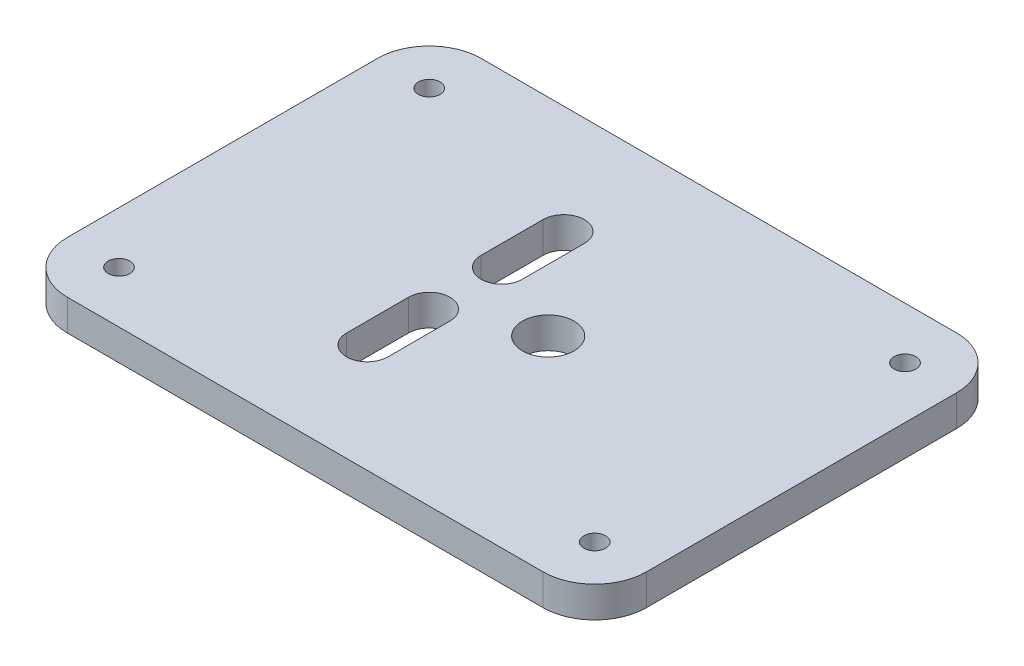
from build123d import *

# Parameters (mm, degrees)
SKETCH1_R         = 5
EXTRUDE1_DEPTH    = 6
M5_TAPPED_HOLE1_D = 4.2


with BuildPart() as part:
    # Sketch1 → Extrude1 (new body)
    with BuildSketch(Plane(origin=(0, 0, 0), x_dir=(1, 0, 0), z_dir=(0, 1, 0))):
        with BuildLine():
            Line((10, 0), (102, 0))
            ThreePointArc((102, 0), (109.071067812, 2.928932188), (112, 10))
            Line((112, 10), (112, 70))
            ThreePointArc((112, 70), (109.071067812, 77.071067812), (102, 80))
            Line((102, 80), (10, 80))
            ThreePointArc((10, 80), (2.928932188, 77.071067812), (0, 70))
            Line((0, 70), (0, 10))
            ThreePointArc((0, 10), (2.928932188, 2.928932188), (10, 0))
        make_face()
        with Locations(Location((63, 40, 0), (0, 0, 270))):
            Circle(SKETCH1_R, mode=Mode.SUBTRACT)
        with BuildLine():
            Line((51, 59), (51, 47))
            ThreePointArc((51, 47), (47, 43), (43, 47))
            Line((43, 47), (43, 59))
            ThreePointArc((43, 59), (47, 63), (51, 59))
        make_face(mode=Mode.SUBTRACT)
        with BuildLine():
            Line((51, 33), (51, 21))
            ThreePointArc((51, 21), (47, 17), (43, 21))
            Line((43, 21), (43, 33))
            ThreePointArc((43, 33), (47, 37), (51, 33))
        make_face(mode=Mode.SUBTRACT)
    extrude(amount=EXTRUDE1_DEPTH)

    # M5 Tapped Hole1 (through all)
    with Locations(Plane(origin=(10, 6, -70), x_dir=(0, 0, 1), z_dir=(0, 1, 0))):
        with Locations((0, 0), (0, 92), (60, 92), (60, 0)):
            Hole(M5_TAPPED_HOLE1_D / 2)


solid = part.part
